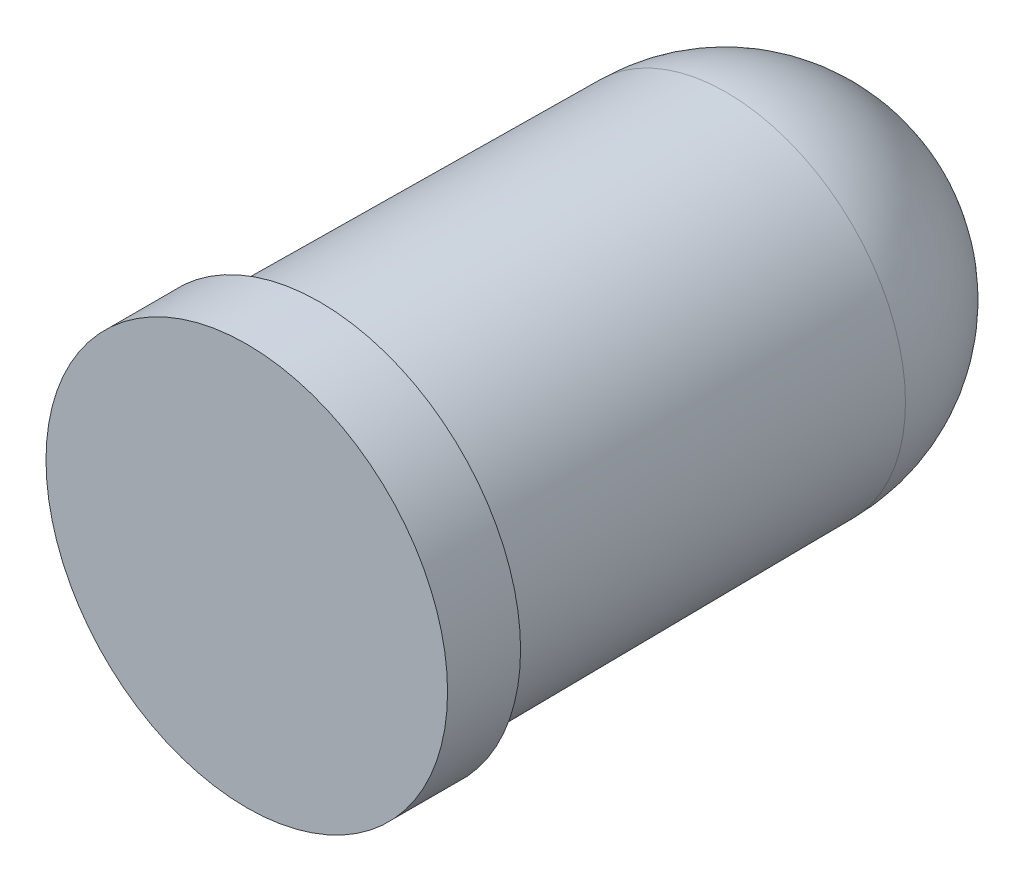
ISO-10303-21;
HEADER;
FILE_DESCRIPTION(('STEP AP214'),'2;1');
FILE_NAME('part.step','',(''),(''),'','','');
FILE_SCHEMA(('AUTOMOTIVE_DESIGN { 1 0 10303 214 1 1 1 1 }'));
ENDSEC;
DATA;
#1=APPLICATION_CONTEXT('core data for automotive mechanical design processes');
#2=APPLICATION_PROTOCOL_DEFINITION('international standard','automotive_design',2000,#1);
#3=PRODUCT_CONTEXT('',#1,'mechanical');
#4=PRODUCT('Part','Part','',(#3));
#5=PRODUCT_RELATED_PRODUCT_CATEGORY('part','',(#4));
#6=PRODUCT_DEFINITION_FORMATION('','',#4);
#7=PRODUCT_DEFINITION_CONTEXT('part definition',#1,'design');
#8=PRODUCT_DEFINITION('design','',#6,#7);
#9=PRODUCT_DEFINITION_SHAPE('','',#8);
#10=(LENGTH_UNIT() NAMED_UNIT(*) SI_UNIT(.MILLI.,.METRE.));
#11=(NAMED_UNIT(*) PLANE_ANGLE_UNIT() SI_UNIT($,.RADIAN.));
#12=(NAMED_UNIT(*) SI_UNIT($,.STERADIAN.) SOLID_ANGLE_UNIT());
#13=UNCERTAINTY_MEASURE_WITH_UNIT(LENGTH_MEASURE(1.E-05),#10,'distance_accuracy_value','');
#14=(GEOMETRIC_REPRESENTATION_CONTEXT(3) GLOBAL_UNCERTAINTY_ASSIGNED_CONTEXT((#13)) GLOBAL_UNIT_ASSIGNED_CONTEXT((#10,
#11,#12)) REPRESENTATION_CONTEXT('',''));
#15=CARTESIAN_POINT('',(0.,0.,0.));
#16=DIRECTION('',(0.,0.,1.));
#17=DIRECTION('',(1.,0.,0.));
#18=AXIS2_PLACEMENT_3D('',#15,#16,#17);
#19=CARTESIAN_POINT('',(0.,0.,-6.548514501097));
#20=DIRECTION('',(0.,0.,1.));
#21=DIRECTION('',(0.,-1.,0.));
#22=AXIS2_PLACEMENT_3D('',#19,#20,#21);
#23=SPHERICAL_SURFACE('',#22,2.451485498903);
#24=CARTESIAN_POINT('',(0.,0.,-9.00000000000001));
#25=VERTEX_POINT('',#24);
#26=VERTEX_LOOP('',#25);
#27=FACE_BOUND('',#26,.T.);
#28=CARTESIAN_POINT('',(0.,0.,-6.56990747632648));
#29=DIRECTION('',(0.,0.,1.));
#30=DIRECTION('',(0.,1.,0.));
#31=AXIS2_PLACEMENT_3D('',#28,#29,#30);
#32=CIRCLE('',#31,2.45139215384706);
#33=CARTESIAN_POINT('',(0.,2.45139215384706,-6.56990747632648));
#34=VERTEX_POINT('',#33);
#35=EDGE_CURVE('E33',#34,#34,#32,.F.);
#36=ORIENTED_EDGE('',*,*,#35,.T.);
#37=EDGE_LOOP('',(#36));
#38=FACE_BOUND('',#37,.T.);
#39=ADVANCED_FACE('F15',(#27,#38),#23,.T.);
#40=CARTESIAN_POINT('',(0.,0.,-6.56990747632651));
#41=DIRECTION('',(0.,0.,1.));
#42=DIRECTION('',(1.,0.,0.));
#43=AXIS2_PLACEMENT_3D('',#40,#41,#42);
#44=CONICAL_SURFACE('',#43,2.45139215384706,0.0087266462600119);
#45=ORIENTED_EDGE('',*,*,#35,.F.);
#46=EDGE_LOOP('',(#45));
#47=FACE_BOUND('',#46,.T.);
#48=CARTESIAN_POINT('',(0.,0.,-1.00000000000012));
#49=DIRECTION('',(0.,0.,1.));
#50=DIRECTION('',(1.,0.,0.));
#51=AXIS2_PLACEMENT_3D('',#48,#49,#50);
#52=CIRCLE('',#51,2.49999999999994);
#53=CARTESIAN_POINT('',(2.49999999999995,0.,-1.00000000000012));
#54=VERTEX_POINT('',#53);
#55=EDGE_CURVE('E19',#54,#54,#52,.F.);
#56=ORIENTED_EDGE('',*,*,#55,.T.);
#57=EDGE_LOOP('',(#56));
#58=FACE_BOUND('',#57,.T.);
#59=ADVANCED_FACE('F29',(#47,#58),#44,.T.);
#60=CARTESIAN_POINT('',(2.862355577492,-2.86,0.));
#61=DIRECTION('',(0.,0.,1.));
#62=DIRECTION('',(0.,1.,0.));
#63=AXIS2_PLACEMENT_3D('',#60,#61,#62);
#64=PLANE('',#63);
#65=CARTESIAN_POINT('',(0.,0.,0.));
#66=DIRECTION('',(0.,0.,1.));
#67=DIRECTION('',(1.,0.,0.));
#68=AXIS2_PLACEMENT_3D('',#65,#66,#67);
#69=CIRCLE('',#68,2.75);
#70=CARTESIAN_POINT('',(2.74999999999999,0.,0.));
#71=VERTEX_POINT('',#70);
#72=EDGE_CURVE('E23',#71,#71,#69,.T.);
#73=ORIENTED_EDGE('',*,*,#72,.T.);
#74=EDGE_LOOP('',(#73));
#75=FACE_BOUND('',#74,.T.);
#76=ADVANCED_FACE('F42',(#75),#64,.T.);
#77=CARTESIAN_POINT('',(2.862355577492,-2.86,-1.));
#78=DIRECTION('',(0.,0.,1.));
#79=DIRECTION('',(0.,1.,0.));
#80=AXIS2_PLACEMENT_3D('',#77,#78,#79);
#81=PLANE('',#80);
#82=ORIENTED_EDGE('',*,*,#55,.F.);
#83=EDGE_LOOP('',(#82));
#84=FACE_BOUND('',#83,.T.);
#85=CARTESIAN_POINT('',(0.,0.,-1.));
#86=DIRECTION('',(0.,0.,1.));
#87=DIRECTION('',(1.,0.,0.));
#88=AXIS2_PLACEMENT_3D('',#85,#86,#87);
#89=CIRCLE('',#88,2.75);
#90=CARTESIAN_POINT('',(2.74999999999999,0.,-1.));
#91=VERTEX_POINT('',#90);
#92=EDGE_CURVE('E10',#91,#91,#89,.F.);
#93=ORIENTED_EDGE('',*,*,#92,.T.);
#94=EDGE_LOOP('',(#93));
#95=FACE_BOUND('',#94,.T.);
#96=ADVANCED_FACE('F17',(#84,#95),#81,.F.);
#97=CARTESIAN_POINT('',(0.,0.,-1.));
#98=DIRECTION('',(0.,0.,1.));
#99=DIRECTION('',(1.,0.,0.));
#100=AXIS2_PLACEMENT_3D('',#97,#98,#99);
#101=CYLINDRICAL_SURFACE('',#100,2.75);
#102=ORIENTED_EDGE('',*,*,#72,.F.);
#103=EDGE_LOOP('',(#102));
#104=FACE_BOUND('',#103,.T.);
#105=ORIENTED_EDGE('',*,*,#92,.F.);
#106=EDGE_LOOP('',(#105));
#107=FACE_BOUND('',#106,.T.);
#108=ADVANCED_FACE('F44',(#104,#107),#101,.T.);
#109=CLOSED_SHELL('',(#39,#59,#76,#96,#108));
#110=MANIFOLD_SOLID_BREP('B1',#109);
#111=ADVANCED_BREP_SHAPE_REPRESENTATION('',(#18,#110),#14);
#112=SHAPE_DEFINITION_REPRESENTATION(#9,#111);
ENDSEC;
END-ISO-10303-21;
